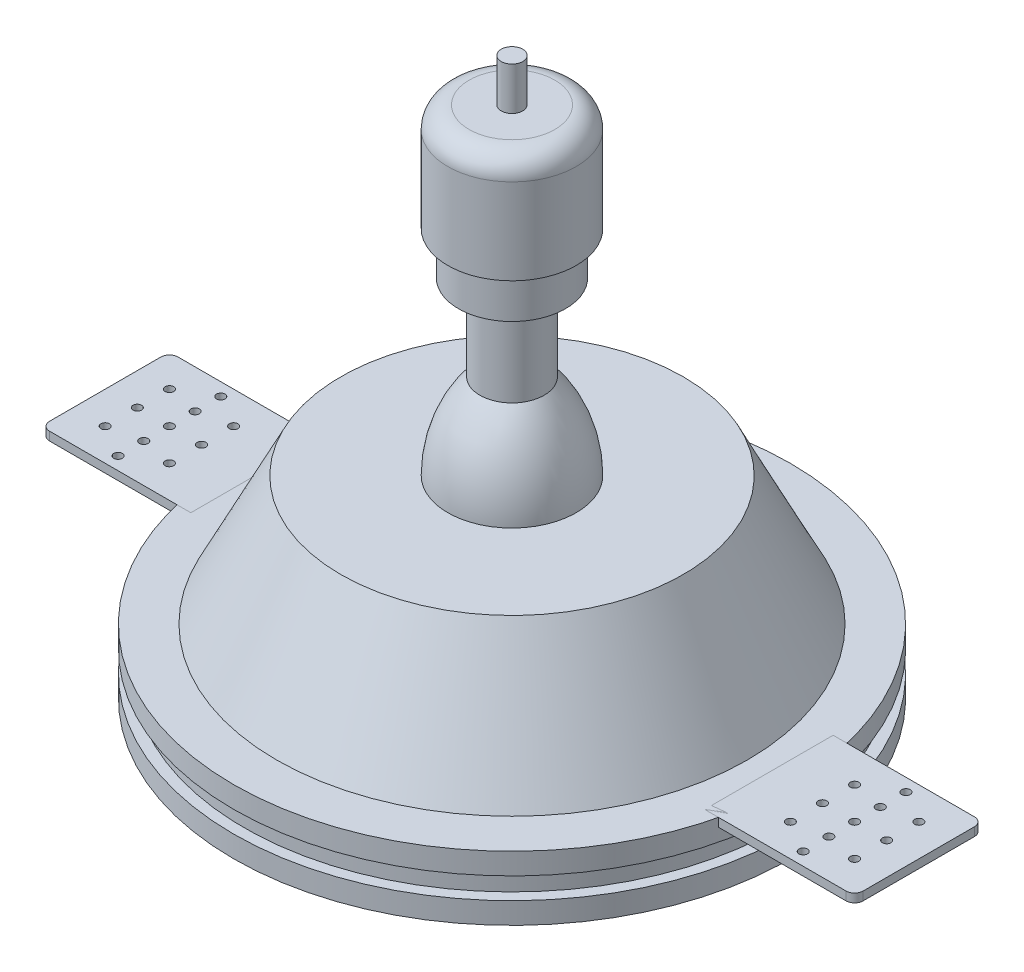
from build123d import *

# Parameters (mm, degrees)
CROQUIS1_W                = 62.5
CROQUIS1_H                = 5
CROQUIS3_R                = 20
CROQUIS2_R                = 35
SALIENTE_EXTRUIR2_DEPTH   = 2
SALIENTE_EXTRUIR2_2_DEPTH = 2
CROQUIS6_R                = 1
CORTAR_EXTRUIR1_DEPTH     = 163.711400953
CROQUIS6_2_R              = 1
CORTAR_EXTRUIR2_DEPTH     = 163.711400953


with BuildPart() as part:
    # Croquis1 → Revoluci_n1 (revolve)
    with BuildSketch(Plane.XY, mode=Mode.PRIVATE) as revoluci_n1_sk:
        Polygon((-65, 0), (0, 0), (0, 5), (-62.5, 5), (-65, 5), align=None)
        with Locations((-31.25, 7.5)):
            Rectangle(CROQUIS1_W, CROQUIS1_H)
        Polygon((-62.5, 10), (0, 10), (0, 15), (-55, 15), (-65, 15), (-65, 10), align=None)
        Polygon((-55, 15), (0, 15), (0, 45), (-15, 45), (-40, 45), align=None)
        with BuildLine():
            Line((-15, 45), (0, 45))
            Line((0, 45), (0, 65))
            Line((0, 65), (-7.5, 65))
            ThreePointArc((-7.5, 65), (-13.063345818, 55.680004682), (-15, 45))
        make_face()
        with BuildLine():
            Line((-7.5, 65), (0, 65))
            Line((0, 65), (0, 130))
            Line((0, 130), (-2.5, 130))
            Line((-2.5, 130), (-2.5, 120))
            Line((-2.5, 120), (-10, 120))
            ThreePointArc((-10, 120), (-13.535533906, 118.535533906), (-15, 115))
            Line((-15, 115), (-15, 95))
            Line((-15, 95), (-12.5, 95))
            Line((-12.5, 95), (-12.5, 85))
            Line((-12.5, 85), (-7.5, 85))
            Line((-7.5, 85), (-7.5, 65))
        make_face()
    revolve(revoluci_n1_sk.sketch.rotate(Axis((0, 0, 0), (0, 1, 0)), 270), axis=Axis((0, 0, 0), (0, 1, 0)))

    # Croquis3 → Cortar-Recubrir1 section 0
    with BuildSketch(Plane(origin=(0, 30, 0), x_dir=(-1, 0, 0), z_dir=(0, -1, 0))):
        Circle(CROQUIS3_R)
    # Croquis2 → Cortar-Recubrir1 section 1
    with BuildSketch(Plane.XZ):
        Circle(CROQUIS2_R)
    loft(mode=Mode.SUBTRACT)


with BuildPart() as body_2:
    # Croquis4 → Saliente-Extruir2 (new body)
    with BuildSketch(Plane(origin=(0, 15, 0), x_dir=(1, 0, 0), z_dir=(0, 1, 0))):
        with BuildLine():
            Line((-60, 15), (-60, -15))
            Line((-60, -15), (-93, -15))
            ThreePointArc((-93, -15), (-94.414213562, -14.414213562), (-95, -13))
            Line((-95, -13), (-95, 13))
            ThreePointArc((-95, 13), (-94.414213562, 14.414213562), (-93, 15))
            Line((-93, 15), (-60, 15))
        make_face()
    extrude(amount=-SALIENTE_EXTRUIR2_DEPTH)

    # Croquis6 → Cortar-Extruir1 (cut, through all)
    with BuildSketch(Plane(origin=(0, 15, 0), x_dir=(1, 0, 0), z_dir=(0, 1, 0))):
        with Locations(Location((-80, 0, 0), (0, 0, 270))):
            Circle(CROQUIS6_R)
        with Locations(Location((-80, 6, 0), (0, 0, 270))):
            Circle(CROQUIS6_R)
        with Locations(Location((-80, 12, 0), (0, 0, 270))):
            Circle(CROQUIS6_R)
        with Locations(Location((-80, -6, 0), (0, 0, 270))):
            Circle(CROQUIS6_R)
        with Locations(Location((-80, -12, 0), (0, 0, 270))):
            Circle(CROQUIS6_R)
        with Locations(Location((-87.5, 7.5, 0), (0, 0, 270))):
            Circle(CROQUIS6_R)
        with Locations(Location((-87.5, 0, 0), (0, 0, 270))):
            Circle(CROQUIS6_R)
        with Locations(Location((-87.5, -7.5, 0), (0, 0, 270))):
            Circle(CROQUIS6_R)
        with Locations(Location((-72.5, -7.5, 0), (0, 0, 270))):
            Circle(CROQUIS6_R)
        with Locations(Location((-72.5, 0, 0), (0, 0, 270))):
            Circle(CROQUIS6_R)
        with Locations(Location((-72.5, 7.5, 0), (0, 0, 270))):
            Circle(CROQUIS6_R)
        with Locations((72.5, 7.5)):
            Circle(CROQUIS6_R)
        with Locations((72.5, 0)):
            Circle(CROQUIS6_R)
        with Locations((72.5, -7.5)):
            Circle(CROQUIS6_R)
        with Locations((87.5, -7.5)):
            Circle(CROQUIS6_R)
        with Locations((87.5, 0)):
            Circle(CROQUIS6_R)
        with Locations((87.5, 7.5)):
            Circle(CROQUIS6_R)
        with Locations((80, -12)):
            Circle(CROQUIS6_R)
        with Locations((80, -6)):
            Circle(CROQUIS6_R)
        with Locations((80, 12)):
            Circle(CROQUIS6_R)
        with Locations((80, 6)):
            Circle(CROQUIS6_R)
        with Locations((80, 0)):
            Circle(CROQUIS6_R)
    extrude(amount=-CORTAR_EXTRUIR1_DEPTH, mode=Mode.SUBTRACT)


with BuildPart() as body_3:
    # Croquis4 → Saliente-Extruir2 2 (new body)
    with BuildSketch(Plane(origin=(0, 15, 0), x_dir=(1, 0, 0), z_dir=(0, 1, 0))):
        with BuildLine():
            Line((95, 13), (95, -13))
            ThreePointArc((95, -13), (94.414213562, -14.414213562), (93, -15))
            Line((93, -15), (60, -15))
            Line((60, -15), (60, 15))
            Line((60, 15), (93, 15))
            ThreePointArc((93, 15), (94.414213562, 14.414213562), (95, 13))
        make_face()
    extrude(amount=-SALIENTE_EXTRUIR2_2_DEPTH)

    # Croquis6_2 → Cortar-Extruir2 (cut, through all)
    with BuildSketch(Plane(origin=(0, 15, 0), x_dir=(1, 0, 0), z_dir=(0, 1, 0))):
        with Locations(Location((-80, 0, 0), (0, 0, 270))):
            Circle(CROQUIS6_2_R)
        with Locations(Location((-80, 6, 0), (0, 0, 270))):
            Circle(CROQUIS6_2_R)
        with Locations(Location((-80, 12, 0), (0, 0, 270))):
            Circle(CROQUIS6_2_R)
        with Locations(Location((-80, -6, 0), (0, 0, 270))):
            Circle(CROQUIS6_2_R)
        with Locations(Location((-80, -12, 0), (0, 0, 270))):
            Circle(CROQUIS6_2_R)
        with Locations(Location((-87.5, 7.5, 0), (0, 0, 270))):
            Circle(CROQUIS6_2_R)
        with Locations(Location((-87.5, 0, 0), (0, 0, 270))):
            Circle(CROQUIS6_2_R)
        with Locations(Location((-87.5, -7.5, 0), (0, 0, 270))):
            Circle(CROQUIS6_2_R)
        with Locations(Location((-72.5, -7.5, 0), (0, 0, 270))):
            Circle(CROQUIS6_2_R)
        with Locations(Location((-72.5, 0, 0), (0, 0, 270))):
            Circle(CROQUIS6_2_R)
        with Locations(Location((-72.5, 7.5, 0), (0, 0, 270))):
            Circle(CROQUIS6_2_R)
        with Locations(Location((72.5, 7.5, 0), (0, 0, 270))):
            Circle(CROQUIS6_2_R)
        with Locations(Location((72.5, 0, 0), (0, 0, 270))):
            Circle(CROQUIS6_2_R)
        with Locations(Location((72.5, -7.5, 0), (0, 0, 270))):
            Circle(CROQUIS6_2_R)
        with Locations(Location((87.5, -7.5, 0), (0, 0, 270))):
            Circle(CROQUIS6_2_R)
        with Locations(Location((87.5, 0, 0), (0, 0, 270))):
            Circle(CROQUIS6_2_R)
        with Locations(Location((87.5, 7.5, 0), (0, 0, 270))):
            Circle(CROQUIS6_2_R)
        with Locations(Location((80, -12, 0), (0, 0, 270))):
            Circle(CROQUIS6_2_R)
        with Locations(Location((80, -6, 0), (0, 0, 270))):
            Circle(CROQUIS6_2_R)
        with Locations(Location((80, 12, 0), (0, 0, 270))):
            Circle(CROQUIS6_2_R)
        with Locations(Location((80, 6, 0), (0, 0, 270))):
            Circle(CROQUIS6_2_R)
        with Locations(Location((80, 0, 0), (0, 0, 270))):
            Circle(CROQUIS6_2_R)
    extrude(amount=-CORTAR_EXTRUIR2_DEPTH, mode=Mode.SUBTRACT)


solid = Compound([part.part, body_2.part, body_3.part])
